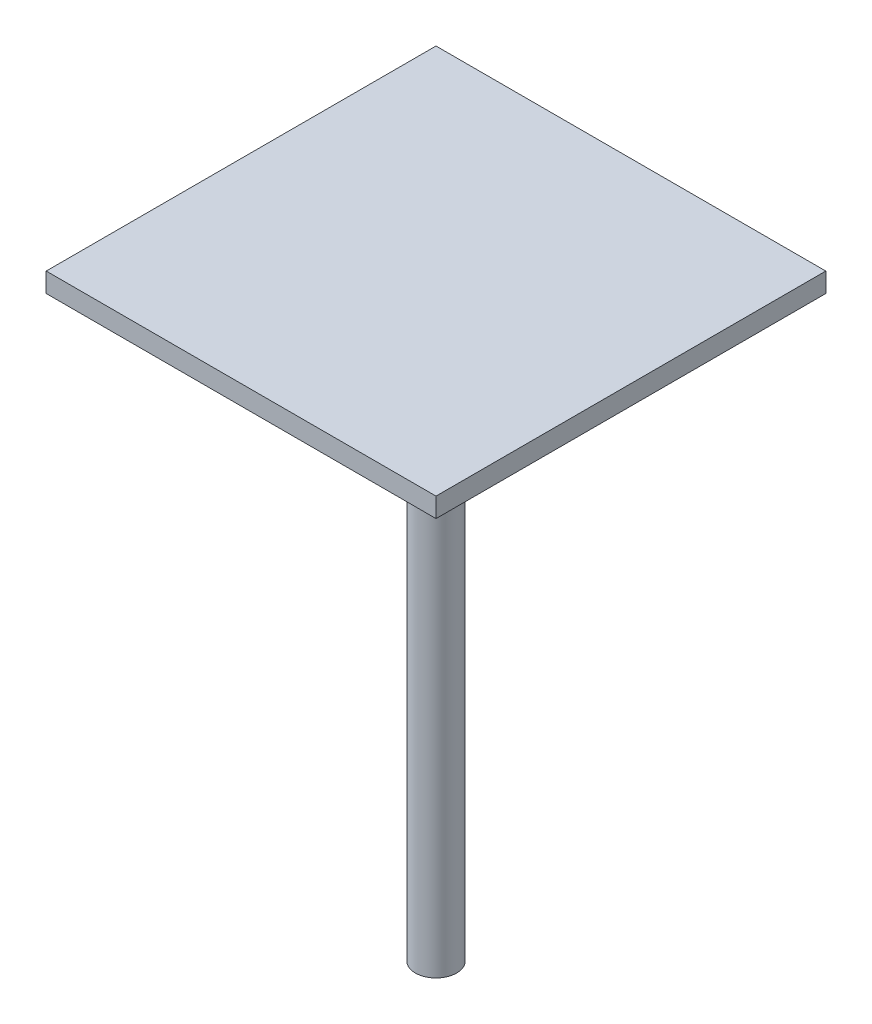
ISO-10303-21;
HEADER;
FILE_DESCRIPTION(('STEP AP214'),'2;1');
FILE_NAME('part.step','',(''),(''),'','','');
FILE_SCHEMA(('AUTOMOTIVE_DESIGN { 1 0 10303 214 1 1 1 1 }'));
ENDSEC;
DATA;
#1=APPLICATION_CONTEXT('core data for automotive mechanical design processes');
#2=APPLICATION_PROTOCOL_DEFINITION('international standard','automotive_design',2000,#1);
#3=PRODUCT_CONTEXT('',#1,'mechanical');
#4=PRODUCT('Part','Part','',(#3));
#5=PRODUCT_RELATED_PRODUCT_CATEGORY('part','',(#4));
#6=PRODUCT_DEFINITION_FORMATION('','',#4);
#7=PRODUCT_DEFINITION_CONTEXT('part definition',#1,'design');
#8=PRODUCT_DEFINITION('design','',#6,#7);
#9=PRODUCT_DEFINITION_SHAPE('','',#8);
#10=(LENGTH_UNIT() NAMED_UNIT(*) SI_UNIT(.MILLI.,.METRE.));
#11=(NAMED_UNIT(*) PLANE_ANGLE_UNIT() SI_UNIT($,.RADIAN.));
#12=(NAMED_UNIT(*) SI_UNIT($,.STERADIAN.) SOLID_ANGLE_UNIT());
#13=UNCERTAINTY_MEASURE_WITH_UNIT(LENGTH_MEASURE(1.E-05),#10,'distance_accuracy_value','');
#14=(GEOMETRIC_REPRESENTATION_CONTEXT(3) GLOBAL_UNCERTAINTY_ASSIGNED_CONTEXT((#13)) GLOBAL_UNIT_ASSIGNED_CONTEXT((#10,
#11,#12)) REPRESENTATION_CONTEXT('',''));
#15=CARTESIAN_POINT('',(0.,0.,0.));
#16=DIRECTION('',(0.,0.,1.));
#17=DIRECTION('',(1.,0.,0.));
#18=AXIS2_PLACEMENT_3D('',#15,#16,#17);
#19=CARTESIAN_POINT('',(-30.,3.,0.));
#20=DIRECTION('',(-1.,0.,0.));
#21=DIRECTION('',(0.,0.,1.));
#22=AXIS2_PLACEMENT_3D('',#19,#20,#21);
#23=PLANE('',#22);
#24=DIRECTION('',(0.,0.,-1.));
#25=VECTOR('',#24,1.);
#26=CARTESIAN_POINT('',(-30.,0.,0.));
#27=LINE('',#26,#25);
#28=CARTESIAN_POINT('',(-29.9999999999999,0.,30.));
#29=VERTEX_POINT('',#28);
#30=CARTESIAN_POINT('',(-30.,0.,-30.));
#31=VERTEX_POINT('',#30);
#32=EDGE_CURVE('E99',#29,#31,#27,.T.);
#33=ORIENTED_EDGE('',*,*,#32,.F.);
#34=DIRECTION('',(0.,-1.,0.));
#35=VECTOR('',#34,1.);
#36=CARTESIAN_POINT('',(-29.9999999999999,3.,30.));
#37=LINE('',#36,#35);
#38=CARTESIAN_POINT('',(-29.9999999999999,3.,30.));
#39=VERTEX_POINT('',#38);
#40=EDGE_CURVE('E11',#39,#29,#37,.T.);
#41=ORIENTED_EDGE('',*,*,#40,.F.);
#42=DIRECTION('',(0.,0.,-1.));
#43=VECTOR('',#42,1.);
#44=CARTESIAN_POINT('',(-30.,3.,0.));
#45=LINE('',#44,#43);
#46=CARTESIAN_POINT('',(-30.,3.,-30.));
#47=VERTEX_POINT('',#46);
#48=EDGE_CURVE('E92',#39,#47,#45,.T.);
#49=ORIENTED_EDGE('',*,*,#48,.T.);
#50=DIRECTION('',(0.,-1.,0.));
#51=VECTOR('',#50,1.);
#52=CARTESIAN_POINT('',(-30.,3.,-30.));
#53=LINE('',#52,#51);
#54=EDGE_CURVE('E73',#47,#31,#53,.T.);
#55=ORIENTED_EDGE('',*,*,#54,.T.);
#56=EDGE_LOOP('',(#33,#41,#49,#55));
#57=FACE_BOUND('',#56,.T.);
#58=ADVANCED_FACE('F35',(#57),#23,.T.);
#59=CARTESIAN_POINT('',(0.,3.,30.));
#60=DIRECTION('',(0.,0.,1.));
#61=DIRECTION('',(1.,0.,0.));
#62=AXIS2_PLACEMENT_3D('',#59,#60,#61);
#63=PLANE('',#62);
#64=DIRECTION('',(-1.,0.,0.));
#65=VECTOR('',#64,1.);
#66=CARTESIAN_POINT('',(0.,0.,30.));
#67=LINE('',#66,#65);
#68=CARTESIAN_POINT('',(30.,0.,30.));
#69=VERTEX_POINT('',#68);
#70=EDGE_CURVE('E86',#69,#29,#67,.T.);
#71=ORIENTED_EDGE('',*,*,#70,.F.);
#72=DIRECTION('',(0.,-1.,0.));
#73=VECTOR('',#72,1.);
#74=CARTESIAN_POINT('',(30.,3.,30.));
#75=LINE('',#74,#73);
#76=CARTESIAN_POINT('',(30.,3.,30.));
#77=VERTEX_POINT('',#76);
#78=EDGE_CURVE('E43',#77,#69,#75,.T.);
#79=ORIENTED_EDGE('',*,*,#78,.F.);
#80=DIRECTION('',(-1.,0.,0.));
#81=VECTOR('',#80,1.);
#82=CARTESIAN_POINT('',(0.,3.,30.));
#83=LINE('',#82,#81);
#84=EDGE_CURVE('E84',#77,#39,#83,.T.);
#85=ORIENTED_EDGE('',*,*,#84,.T.);
#86=ORIENTED_EDGE('',*,*,#40,.T.);
#87=EDGE_LOOP('',(#71,#79,#85,#86));
#88=FACE_BOUND('',#87,.T.);
#89=ADVANCED_FACE('F82',(#88),#63,.T.);
#90=CARTESIAN_POINT('',(30.,3.,0.));
#91=DIRECTION('',(-1.,0.,0.));
#92=DIRECTION('',(0.,0.,1.));
#93=AXIS2_PLACEMENT_3D('',#90,#91,#92);
#94=PLANE('',#93);
#95=DIRECTION('',(0.,0.,-1.));
#96=VECTOR('',#95,1.);
#97=CARTESIAN_POINT('',(30.,0.,0.));
#98=LINE('',#97,#96);
#99=CARTESIAN_POINT('',(30.,0.,-30.));
#100=VERTEX_POINT('',#99);
#101=EDGE_CURVE('E66',#69,#100,#98,.T.);
#102=ORIENTED_EDGE('',*,*,#101,.T.);
#103=DIRECTION('',(0.,-1.,0.));
#104=VECTOR('',#103,1.);
#105=CARTESIAN_POINT('',(30.,3.,-30.));
#106=LINE('',#105,#104);
#107=CARTESIAN_POINT('',(30.,3.,-30.));
#108=VERTEX_POINT('',#107);
#109=EDGE_CURVE('E87',#108,#100,#106,.T.);
#110=ORIENTED_EDGE('',*,*,#109,.F.);
#111=DIRECTION('',(0.,0.,-1.));
#112=VECTOR('',#111,1.);
#113=CARTESIAN_POINT('',(30.,3.,0.));
#114=LINE('',#113,#112);
#115=EDGE_CURVE('E88',#77,#108,#114,.T.);
#116=ORIENTED_EDGE('',*,*,#115,.F.);
#117=ORIENTED_EDGE('',*,*,#78,.T.);
#118=EDGE_LOOP('',(#102,#110,#116,#117));
#119=FACE_BOUND('',#118,.T.);
#120=ADVANCED_FACE('F89',(#119),#94,.F.);
#121=CARTESIAN_POINT('',(0.,3.,-30.));
#122=DIRECTION('',(0.,0.,1.));
#123=DIRECTION('',(1.,0.,0.));
#124=AXIS2_PLACEMENT_3D('',#121,#122,#123);
#125=PLANE('',#124);
#126=DIRECTION('',(-1.,0.,0.));
#127=VECTOR('',#126,1.);
#128=CARTESIAN_POINT('',(0.,0.,-30.));
#129=LINE('',#128,#127);
#130=EDGE_CURVE('E94',#100,#31,#129,.T.);
#131=ORIENTED_EDGE('',*,*,#130,.T.);
#132=ORIENTED_EDGE('',*,*,#54,.F.);
#133=DIRECTION('',(-1.,0.,0.));
#134=VECTOR('',#133,1.);
#135=CARTESIAN_POINT('',(0.,3.,-30.));
#136=LINE('',#135,#134);
#137=EDGE_CURVE('E51',#108,#47,#136,.T.);
#138=ORIENTED_EDGE('',*,*,#137,.F.);
#139=ORIENTED_EDGE('',*,*,#109,.T.);
#140=EDGE_LOOP('',(#131,#132,#138,#139));
#141=FACE_BOUND('',#140,.T.);
#142=ADVANCED_FACE('F109',(#141),#125,.F.);
#143=CARTESIAN_POINT('',(0.,3.,0.));
#144=DIRECTION('',(0.,1.,0.));
#145=DIRECTION('',(0.,0.,1.));
#146=AXIS2_PLACEMENT_3D('',#143,#144,#145);
#147=PLANE('',#146);
#148=ORIENTED_EDGE('',*,*,#48,.F.);
#149=ORIENTED_EDGE('',*,*,#84,.F.);
#150=ORIENTED_EDGE('',*,*,#115,.T.);
#151=ORIENTED_EDGE('',*,*,#137,.T.);
#152=EDGE_LOOP('',(#148,#149,#150,#151));
#153=FACE_BOUND('',#152,.T.);
#154=ADVANCED_FACE('F91',(#153),#147,.T.);
#155=CARTESIAN_POINT('',(0.,0.,0.));
#156=DIRECTION('',(0.,1.,0.));
#157=DIRECTION('',(0.,0.,1.));
#158=AXIS2_PLACEMENT_3D('',#155,#156,#157);
#159=PLANE('',#158);
#160=CARTESIAN_POINT('',(0.,0.,0.));
#161=DIRECTION('',(0.,1.,0.));
#162=DIRECTION('',(0.,0.,1.));
#163=AXIS2_PLACEMENT_3D('',#160,#161,#162);
#164=CIRCLE('',#163,3.175);
#165=CARTESIAN_POINT('',(0.,0.,3.175));
#166=VERTEX_POINT('',#165);
#167=EDGE_CURVE('E139',#166,#166,#164,.T.);
#168=ORIENTED_EDGE('',*,*,#167,.T.);
#169=EDGE_LOOP('',(#168));
#170=FACE_BOUND('',#169,.T.);
#171=ORIENTED_EDGE('',*,*,#32,.T.);
#172=ORIENTED_EDGE('',*,*,#130,.F.);
#173=ORIENTED_EDGE('',*,*,#101,.F.);
#174=ORIENTED_EDGE('',*,*,#70,.T.);
#175=EDGE_LOOP('',(#171,#172,#173,#174));
#176=FACE_BOUND('',#175,.T.);
#177=ADVANCED_FACE('F111',(#170,#176),#159,.F.);
#178=CARTESIAN_POINT('',(0.,-89.,0.));
#179=DIRECTION('',(0.,1.,0.));
#180=DIRECTION('',(0.,0.,1.));
#181=AXIS2_PLACEMENT_3D('',#178,#179,#180);
#182=CYLINDRICAL_SURFACE('',#181,3.175);
#183=CARTESIAN_POINT('',(0.,-89.,0.));
#184=DIRECTION('',(0.,1.,0.));
#185=DIRECTION('',(0.,0.,1.));
#186=AXIS2_PLACEMENT_3D('',#183,#184,#185);
#187=CIRCLE('',#186,3.175);
#188=CARTESIAN_POINT('',(0.,-89.,3.175));
#189=VERTEX_POINT('',#188);
#190=EDGE_CURVE('E102',#189,#189,#187,.T.);
#191=ORIENTED_EDGE('',*,*,#190,.T.);
#192=EDGE_LOOP('',(#191));
#193=FACE_BOUND('',#192,.T.);
#194=ORIENTED_EDGE('',*,*,#167,.F.);
#195=EDGE_LOOP('',(#194));
#196=FACE_BOUND('',#195,.T.);
#197=ADVANCED_FACE('F125',(#193,#196),#182,.T.);
#198=CARTESIAN_POINT('',(0.,-89.,0.));
#199=DIRECTION('',(0.,1.,0.));
#200=DIRECTION('',(0.,0.,1.));
#201=AXIS2_PLACEMENT_3D('',#198,#199,#200);
#202=PLANE('',#201);
#203=ORIENTED_EDGE('',*,*,#190,.F.);
#204=EDGE_LOOP('',(#203));
#205=FACE_BOUND('',#204,.T.);
#206=ADVANCED_FACE('F131',(#205),#202,.F.);
#207=CLOSED_SHELL('',(#58,#89,#120,#142,#154,#177,#197,#206));
#208=MANIFOLD_SOLID_BREP('B2',#207);
#209=ADVANCED_BREP_SHAPE_REPRESENTATION('',(#18,#208),#14);
#210=SHAPE_DEFINITION_REPRESENTATION(#9,#209);
ENDSEC;
END-ISO-10303-21;
